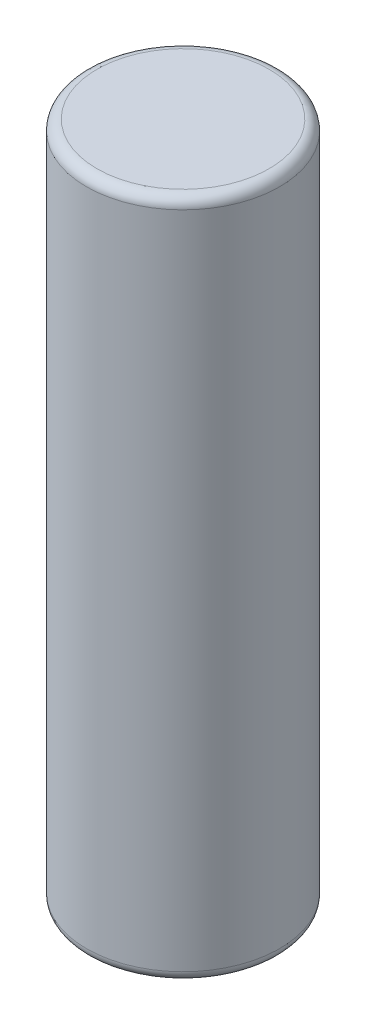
from build123d import *

# Parameters (mm, degrees)
SKETCH1_R           = 9.25
BOSS_EXTRUDE1_DEPTH = 65.2
FILLET2_R           = 1


with BuildPart() as part:
    # Sketch1 → Boss-Extrude1 (new body)
    with BuildSketch(Plane(origin=(0, 0, 0), x_dir=(1, 0, 0), z_dir=(0, 1, 0))):
        with Locations(Location((0, 0, 0), (0, 0, 270))):
            Circle(SKETCH1_R)
    extrude(amount=BOSS_EXTRUDE1_DEPTH)

    # Fillet2
    fillet2_edges = [part.edges().sort_by_distance(p)[0] for p in [
        (0, 0, -9.25),
        (0, 65.2, -9.25),
    ]]
    fillet(fillet2_edges, radius=FILLET2_R)


solid = part.part
